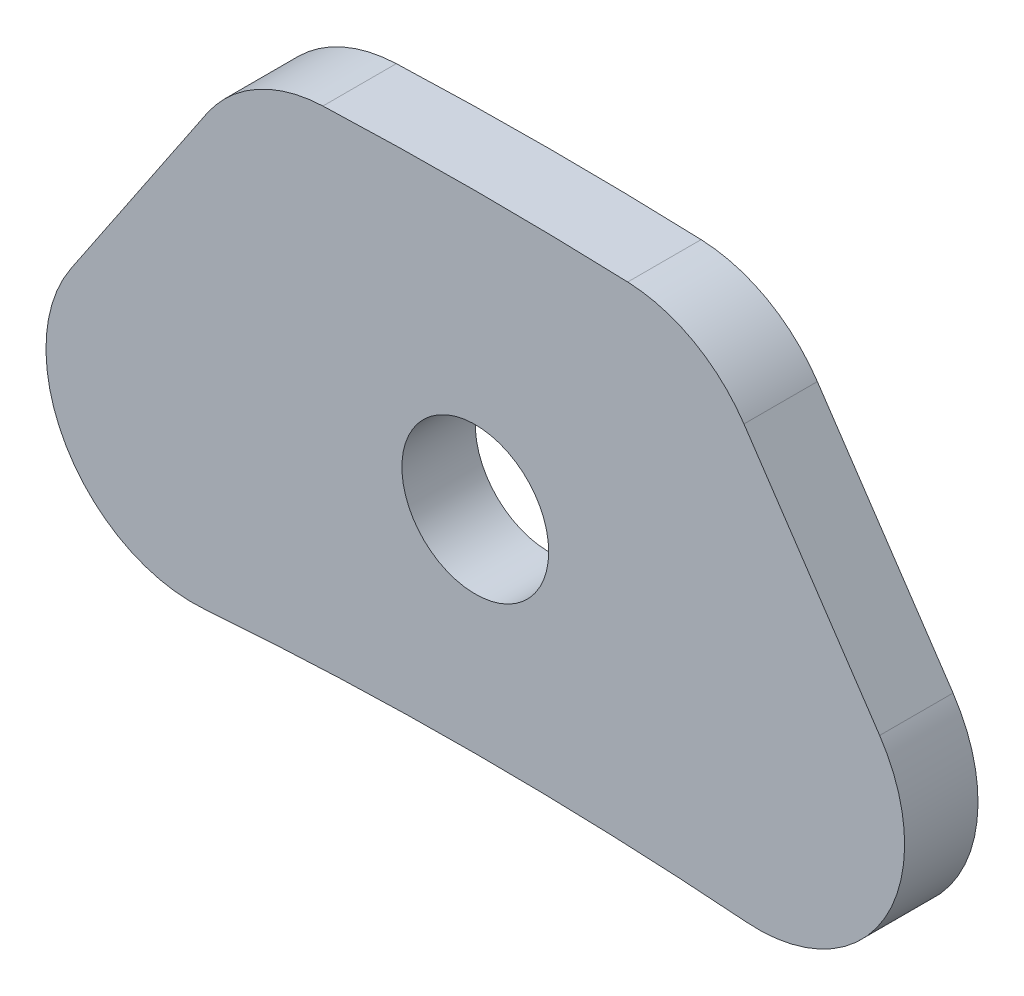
from build123d import *

# Parameters (mm, degrees)
SKETCH1_R      = 1.5875
EXTRUDE1_DEPTH = 1.5875


with BuildPart() as part:
    # Sketch1 → Extrude1 (new body)
    with BuildSketch(Plane.XY):
        with BuildLine():
            Line((5.810114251, 85.213217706), (8.744765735, 80.846926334))
            ThreePointArc((8.744765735, 80.846926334), (8.852155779, 77.476045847), (5.865069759, 75.910260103))
            ThreePointArc((5.865069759, 75.910260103), (0, 76.1365), (-5.865069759, 75.910260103))
            ThreePointArc((-5.865069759, 75.910260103), (-8.852155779, 77.476045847), (-8.744765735, 80.846926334))
            Line((-8.744765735, 80.846926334), (-5.810114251, 85.213217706))
            ThreePointArc((-5.810114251, 85.213217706), (-4.720891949, 86.215353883), (-3.295722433, 86.614821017))
            ThreePointArc((-3.295722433, 86.614821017), (0, 86.6775), (3.295722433, 86.614821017))
            ThreePointArc((3.295722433, 86.614821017), (4.720891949, 86.215353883), (5.810114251, 85.213217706))
        make_face()
        with Locations((0, 80.7085)):
            Circle(SKETCH1_R, mode=Mode.SUBTRACT)
    extrude(amount=EXTRUDE1_DEPTH)


solid = part.part
